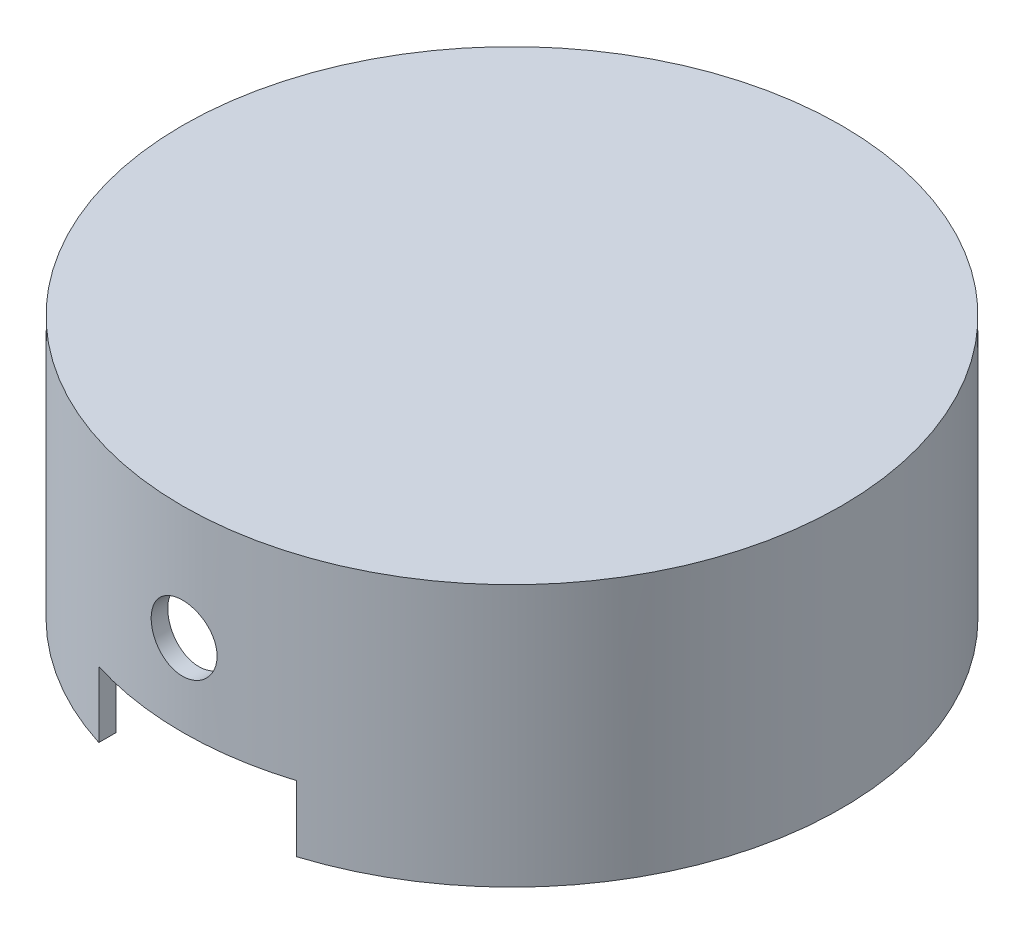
ISO-10303-21;
HEADER;
FILE_DESCRIPTION(('STEP AP214'),'2;1');
FILE_NAME('part.step','',(''),(''),'','','');
FILE_SCHEMA(('AUTOMOTIVE_DESIGN { 1 0 10303 214 1 1 1 1 }'));
ENDSEC;
DATA;
#1=APPLICATION_CONTEXT('core data for automotive mechanical design processes');
#2=APPLICATION_PROTOCOL_DEFINITION('international standard','automotive_design',2000,#1);
#3=PRODUCT_CONTEXT('',#1,'mechanical');
#4=PRODUCT('Part','Part','',(#3));
#5=PRODUCT_RELATED_PRODUCT_CATEGORY('part','',(#4));
#6=PRODUCT_DEFINITION_FORMATION('','',#4);
#7=PRODUCT_DEFINITION_CONTEXT('part definition',#1,'design');
#8=PRODUCT_DEFINITION('design','',#6,#7);
#9=PRODUCT_DEFINITION_SHAPE('','',#8);
#10=(LENGTH_UNIT() NAMED_UNIT(*) SI_UNIT(.MILLI.,.METRE.));
#11=(NAMED_UNIT(*) PLANE_ANGLE_UNIT() SI_UNIT($,.RADIAN.));
#12=(NAMED_UNIT(*) SI_UNIT($,.STERADIAN.) SOLID_ANGLE_UNIT());
#13=UNCERTAINTY_MEASURE_WITH_UNIT(LENGTH_MEASURE(1.E-05),#10,'distance_accuracy_value','');
#14=(GEOMETRIC_REPRESENTATION_CONTEXT(3) GLOBAL_UNCERTAINTY_ASSIGNED_CONTEXT((#13)) GLOBAL_UNIT_ASSIGNED_CONTEXT((#10,
#11,#12)) REPRESENTATION_CONTEXT('',''));
#15=CARTESIAN_POINT('',(0.,0.,0.));
#16=DIRECTION('',(0.,0.,1.));
#17=DIRECTION('',(1.,0.,0.));
#18=AXIS2_PLACEMENT_3D('',#15,#16,#17);
#19=CARTESIAN_POINT('',(0.,-50.4824999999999,0.));
#20=DIRECTION('',(0.,1.,0.));
#21=DIRECTION('',(0.,0.,1.));
#22=AXIS2_PLACEMENT_3D('',#19,#20,#21);
#23=PLANE('',#22);
#24=CARTESIAN_POINT('',(0.,-50.4824999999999,0.));
#25=DIRECTION('',(0.,1.,0.));
#26=DIRECTION('',(0.,0.,1.));
#27=AXIS2_PLACEMENT_3D('',#24,#25,#26);
#28=CIRCLE('',#27,63.5);
#29=CARTESIAN_POINT('',(19.05,-50.4824999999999,60.575139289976));
#30=VERTEX_POINT('',#29);
#31=CARTESIAN_POINT('',(19.05,-50.4824999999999,-60.5751392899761));
#32=VERTEX_POINT('',#31);
#33=EDGE_CURVE('E152',#30,#32,#28,.T.);
#34=ORIENTED_EDGE('',*,*,#33,.F.);
#35=DIRECTION('',(0.,0.,1.));
#36=VECTOR('',#35,1.);
#37=CARTESIAN_POINT('',(19.05,-50.4824999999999,-63.5));
#38=LINE('',#37,#36);
#39=CARTESIAN_POINT('',(19.05,-50.4824999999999,57.2381264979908));
#40=VERTEX_POINT('',#39);
#41=EDGE_CURVE('E194',#40,#30,#38,.T.);
#42=ORIENTED_EDGE('',*,*,#41,.F.);
#43=CARTESIAN_POINT('',(0.,-50.4824999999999,0.));
#44=DIRECTION('',(0.,1.,0.));
#45=DIRECTION('',(0.,0.,1.));
#46=AXIS2_PLACEMENT_3D('',#43,#44,#45);
#47=CIRCLE('',#46,60.325);
#48=CARTESIAN_POINT('',(19.05,-50.4824999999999,-57.2381264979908));
#49=VERTEX_POINT('',#48);
#50=EDGE_CURVE('E146',#40,#49,#47,.T.);
#51=ORIENTED_EDGE('',*,*,#50,.T.);
#52=EDGE_CURVE('E133',#32,#49,#38,.T.);
#53=ORIENTED_EDGE('',*,*,#52,.F.);
#54=EDGE_LOOP('',(#34,#42,#51,#53));
#55=FACE_BOUND('',#54,.T.);
#56=ADVANCED_FACE('F35',(#55),#23,.F.);
#57=CARTESIAN_POINT('',(0.,-50.4824999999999,0.));
#58=DIRECTION('',(0.,1.,0.));
#59=DIRECTION('',(0.,0.,1.));
#60=AXIS2_PLACEMENT_3D('',#57,#58,#59);
#61=CYLINDRICAL_SURFACE('',#60,63.5);
#62=CARTESIAN_POINT('',(6.35,-22.06625,-63.1817022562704));
#63=CARTESIAN_POINT('',(6.3500017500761,-22.2441750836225,-63.1817017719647));
#64=CARTESIAN_POINT('',(6.34251906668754,-22.4220734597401,-63.1824553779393));
#65=CARTESIAN_POINT('',(6.31264389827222,-22.7766583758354,-63.185447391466));
#66=CARTESIAN_POINT('',(6.2902478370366,-22.9533446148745,-63.1876861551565));
#67=CARTESIAN_POINT('',(6.23068068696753,-23.3043257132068,-63.1935875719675));
#68=CARTESIAN_POINT('',(6.19349781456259,-23.4786185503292,-63.1972513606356));
#69=CARTESIAN_POINT('',(6.10461324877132,-23.8234972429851,-63.2058991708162));
#70=CARTESIAN_POINT('',(6.05290624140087,-23.9940817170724,-63.2108836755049));
#71=CARTESIAN_POINT('',(5.93541227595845,-24.3301028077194,-63.2220242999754));
#72=CARTESIAN_POINT('',(5.86963914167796,-24.495544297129,-63.2281792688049));
#73=CARTESIAN_POINT('',(5.7244295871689,-24.8203494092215,-63.2414912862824));
#74=CARTESIAN_POINT('',(5.64498813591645,-24.9797107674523,-63.2486487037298));
#75=CARTESIAN_POINT('',(5.47307546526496,-25.2910839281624,-63.2637564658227));
#76=CARTESIAN_POINT('',(5.38061172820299,-25.4430998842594,-63.2717063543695));
#77=CARTESIAN_POINT('',(5.18323831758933,-25.7388733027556,-63.288180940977));
#78=CARTESIAN_POINT('',(5.07832404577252,-25.8826276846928,-63.2967058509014));
#79=CARTESIAN_POINT('',(4.85649733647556,-26.1612138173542,-63.314112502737));
#80=CARTESIAN_POINT('',(4.73955137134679,-26.2960188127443,-63.3229951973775));
#81=CARTESIAN_POINT('',(4.49469000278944,-26.5553564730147,-63.3408464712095));
#82=CARTESIAN_POINT('',(4.36677056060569,-26.6798853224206,-63.3498150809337));
#83=CARTESIAN_POINT('',(4.10094045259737,-26.9177015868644,-63.3675786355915));
#84=CARTESIAN_POINT('',(3.96303302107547,-27.0309926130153,-63.3763736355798));
#85=CARTESIAN_POINT('',(3.67810498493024,-27.2456194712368,-63.3935479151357));
#86=CARTESIAN_POINT('',(3.53108103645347,-27.3469508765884,-63.4019270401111));
#87=CARTESIAN_POINT('',(3.22873480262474,-27.5370555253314,-63.4180433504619));
#88=CARTESIAN_POINT('',(3.07339857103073,-27.6258066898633,-63.425779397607));
#89=CARTESIAN_POINT('',(2.75570516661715,-27.7899352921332,-63.4403766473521));
#90=CARTESIAN_POINT('',(2.59334541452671,-27.8653077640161,-63.4472375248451));
#91=CARTESIAN_POINT('',(2.2628583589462,-28.0020669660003,-63.4598831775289));
#92=CARTESIAN_POINT('',(2.09473332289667,-28.0634591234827,-63.4656683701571));
#93=CARTESIAN_POINT('',(1.75385494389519,-28.1718656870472,-63.4760047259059));
#94=CARTESIAN_POINT('',(1.58109992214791,-28.2188747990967,-63.4805554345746));
#95=CARTESIAN_POINT('',(1.0590306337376,-28.3374295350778,-63.4921149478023));
#96=CARTESIAN_POINT('',(0.704424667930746,-28.3871161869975,-63.4970898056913));
#97=CARTESIAN_POINT('',(-0.00793262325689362,-28.4262709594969,-63.5010003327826));
#98=CARTESIAN_POINT('',(-0.365683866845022,-28.4157406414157,-63.4999361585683));
#99=CARTESIAN_POINT('',(-1.07306478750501,-28.335000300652,-63.4919139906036));
#100=CARTESIAN_POINT('',(-1.42271891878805,-28.2650036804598,-63.484977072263));
#101=CARTESIAN_POINT('',(-2.10527764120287,-28.0676291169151,-63.466010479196));
#102=CARTESIAN_POINT('',(-2.43818201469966,-27.9402504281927,-63.4539807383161));
#103=CARTESIAN_POINT('',(-3.07848096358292,-27.6314991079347,-63.4261454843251));
#104=CARTESIAN_POINT('',(-3.38582969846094,-27.4500320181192,-63.4103333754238));
#105=CARTESIAN_POINT('',(-3.96578808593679,-27.0383221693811,-63.3767074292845));
#106=CARTESIAN_POINT('',(-4.23839671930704,-26.8080779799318,-63.3588935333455));
#107=CARTESIAN_POINT('',(-4.7423880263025,-26.3041496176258,-63.3231711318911));
#108=CARTESIAN_POINT('',(-4.97358506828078,-26.0302797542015,-63.3052625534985));
#109=CARTESIAN_POINT('',(-5.3867528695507,-25.447517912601,-63.2714469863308));
#110=CARTESIAN_POINT('',(-5.56872355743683,-25.1386258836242,-63.2555400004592));
#111=CARTESIAN_POINT('',(-5.8782723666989,-24.4944453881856,-63.2275271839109));
#112=CARTESIAN_POINT('',(-6.00583901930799,-24.1591513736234,-63.215422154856));
#113=CARTESIAN_POINT('',(-6.20281167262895,-23.471755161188,-63.1964002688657));
#114=CARTESIAN_POINT('',(-6.27221944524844,-23.1196534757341,-63.1894832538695));
#115=CARTESIAN_POINT('',(-6.35066532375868,-22.4102664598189,-63.1816478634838));
#116=CARTESIAN_POINT('',(-6.35996313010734,-22.053010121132,-63.1807036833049));
#117=CARTESIAN_POINT('',(-6.31860716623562,-21.342024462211,-63.1848527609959));
#118=CARTESIAN_POINT('',(-6.26795420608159,-20.9882950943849,-63.1899459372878));
#119=CARTESIAN_POINT('',(-6.10835186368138,-20.2951614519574,-63.2055723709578));
#120=CARTESIAN_POINT('',(-5.99952527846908,-19.9557286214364,-63.2160941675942));
#121=CARTESIAN_POINT('',(-5.72679014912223,-19.2999356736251,-63.2413829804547));
#122=CARTESIAN_POINT('',(-5.56288034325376,-18.9835760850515,-63.2561500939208));
#123=CARTESIAN_POINT('',(-5.1839813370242,-18.3817261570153,-63.2883281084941));
#124=CARTESIAN_POINT('',(-4.9688200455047,-18.0963446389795,-63.3057478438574));
#125=CARTESIAN_POINT('',(-4.49377109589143,-17.5656554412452,-63.3412393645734));
#126=CARTESIAN_POINT('',(-4.23388233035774,-17.3203487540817,-63.3593111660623));
#127=CARTESIAN_POINT('',(-3.67563384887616,-16.8758765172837,-63.3941485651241));
#128=CARTESIAN_POINT('',(-3.3771389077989,-16.6768803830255,-63.4109092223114));
#129=CARTESIAN_POINT('',(-2.75080142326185,-16.3318456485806,-63.4411634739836));
#130=CARTESIAN_POINT('',(-2.42295928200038,-16.1858063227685,-63.4546571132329));
#131=CARTESIAN_POINT('',(-1.74789161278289,-15.9511110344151,-63.4768362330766));
#132=CARTESIAN_POINT('',(-1.40070185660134,-15.8623527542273,-63.4855302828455));
#133=CARTESIAN_POINT('',(-0.696060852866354,-15.744430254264,-63.4971598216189));
#134=CARTESIAN_POINT('',(-0.338609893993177,-15.7152643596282,-63.5000954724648));
#135=CARTESIAN_POINT('',(0.196292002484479,-15.7167810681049,-63.4999484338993));
#136=CARTESIAN_POINT('',(0.374087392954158,-15.7247805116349,-63.4991460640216));
#137=CARTESIAN_POINT('',(0.728350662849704,-15.7556591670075,-63.496068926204));
#138=CARTESIAN_POINT('',(0.904819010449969,-15.7785328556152,-63.4937947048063));
#139=CARTESIAN_POINT('',(1.25524246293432,-15.8390107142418,-63.4878344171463));
#140=CARTESIAN_POINT('',(1.42919662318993,-15.8766202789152,-63.4841478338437));
#141=CARTESIAN_POINT('',(1.77324566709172,-15.9662758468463,-63.4754692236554));
#142=CARTESIAN_POINT('',(1.94334193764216,-16.0183165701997,-63.4704776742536));
#143=CARTESIAN_POINT('',(2.27857375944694,-16.1364779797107,-63.4593274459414));
#144=CARTESIAN_POINT('',(2.44370818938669,-16.2026018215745,-63.4531685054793));
#145=CARTESIAN_POINT('',(2.76775783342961,-16.3484206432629,-63.4398597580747));
#146=CARTESIAN_POINT('',(2.92667529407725,-16.4281106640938,-63.4327103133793));
#147=CARTESIAN_POINT('',(3.23729834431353,-16.6005418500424,-63.4176165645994));
#148=CARTESIAN_POINT('',(3.38900136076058,-16.6932876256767,-63.4096719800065));
#149=CARTESIAN_POINT('',(3.6840239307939,-16.8911171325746,-63.3932156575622));
#150=CARTESIAN_POINT('',(3.82734650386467,-16.9961963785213,-63.3847041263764));
#151=CARTESIAN_POINT('',(4.10530492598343,-17.2184892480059,-63.3673098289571));
#152=CARTESIAN_POINT('',(4.23989814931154,-17.3357560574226,-63.3584255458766));
#153=CARTESIAN_POINT('',(4.49868758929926,-17.5811528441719,-63.3405764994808));
#154=CARTESIAN_POINT('',(4.62288758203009,-17.7092788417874,-63.3316117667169));
#155=CARTESIAN_POINT('',(4.86014582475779,-17.9756133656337,-63.31384641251));
#156=CARTESIAN_POINT('',(4.97319724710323,-18.1138279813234,-63.3050458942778));
#157=CARTESIAN_POINT('',(5.18723467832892,-18.3992479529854,-63.2878671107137));
#158=CARTESIAN_POINT('',(5.28822512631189,-18.5464499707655,-63.279488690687));
#159=CARTESIAN_POINT('',(5.47774928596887,-18.8493004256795,-63.2633649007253));
#160=CARTESIAN_POINT('',(5.56624575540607,-19.0049722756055,-63.2556214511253));
#161=CARTESIAN_POINT('',(5.72976430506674,-19.323205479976,-63.2410194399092));
#162=CARTESIAN_POINT('',(5.80479131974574,-19.4857642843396,-63.2341605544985));
#163=CARTESIAN_POINT('',(5.94081215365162,-19.8165391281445,-63.2215265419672));
#164=CARTESIAN_POINT('',(6.00181747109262,-19.9847504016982,-63.2157505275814));
#165=CARTESIAN_POINT('',(6.10941404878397,-20.3256989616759,-63.2054425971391));
#166=CARTESIAN_POINT('',(6.15600885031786,-20.4984351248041,-63.20091037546));
#167=CARTESIAN_POINT('',(6.24659918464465,-20.901235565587,-63.1920304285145));
#168=CARTESIAN_POINT('',(6.28533720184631,-21.1325126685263,-63.1881729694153));
#169=CARTESIAN_POINT('',(6.33703640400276,-21.5979586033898,-63.1830092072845));
#170=CARTESIAN_POINT('',(6.34999769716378,-21.832127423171,-63.1817028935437));
#171=CARTESIAN_POINT('',(6.35,-22.06625,-63.1817022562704));
#172=B_SPLINE_CURVE_WITH_KNOTS('',3,(#62,#63,#64,#65,#66,#67,#68,#69,#70,#71,#72,#73,#74,#75,
#76,#77,#78,#79,#80,#81,#82,#83,#84,#85,#86,#87,#88,#89,#90,#91,#92,#93,#94,#95,#96,#97,#98,#99,
#100,#101,#102,#103,#104,#105,#106,#107,#108,#109,#110,#111,#112,#113,#114,#115,#116,#117,#118,
#119,#120,#121,#122,#123,#124,#125,#126,#127,#128,#129,#130,#131,#132,#133,#134,#135,#136,#137,
#138,#139,#140,#141,#142,#143,#144,#145,#146,#147,#148,#149,#150,#151,#152,#153,#154,#155,#156,
#157,#158,#159,#160,#161,#162,#163,#164,#165,#166,#167,#168,#169,#170,#171),.UNSPECIFIED.,.T.,
.F.,(4,2,2,2,2,2,2,2,2,2,2,2,2,2,2,2,2,2,2,2,2,2,2,2,2,2,2,2,2,2,2,2,2,2,2,2,2,2,2,2,2,2,2,2,2,
2,2,2,2,2,2,2,2,2,4),(0.,0.533570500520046,1.06726899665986,1.60139365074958,2.13571398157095,
2.6695115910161,3.20350610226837,3.73719503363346,4.27108168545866,4.80649858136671,
5.34211338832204,5.87755552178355,6.41319522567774,6.94976365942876,7.48653084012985,
8.0230892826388,8.55984498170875,9.62858735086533,10.6973020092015,11.7621975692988,
12.8271069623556,13.893887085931,14.9606985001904,16.0321784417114,17.103659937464,
18.1753671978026,19.2470418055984,20.3140832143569,21.38111020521,22.4458936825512,
23.5107015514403,24.5791365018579,25.6475979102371,26.7199086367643,27.7922046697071,
28.8625799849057,29.9329252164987,30.4663374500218,30.9995517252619,31.5329613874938,
32.066176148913,32.59951051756,33.1326503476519,33.6659789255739,34.1991141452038,
34.7346822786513,35.2700549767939,35.8057535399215,36.34125432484,36.8783190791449,
37.4151866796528,37.9516124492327,38.4879062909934,39.1900075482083,39.8921058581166),.UNSPECIFIED.);
#173=CARTESIAN_POINT('',(6.35,-22.06625,-63.1817022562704));
#174=VERTEX_POINT('',#173);
#175=EDGE_CURVE('E185',#174,#174,#172,.T.);
#176=ORIENTED_EDGE('',*,*,#175,.F.);
#177=EDGE_LOOP('',(#176));
#178=FACE_BOUND('',#177,.T.);
#179=CARTESIAN_POINT('',(0.,-28.41625,63.5));
#180=CARTESIAN_POINT('',(0.177927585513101,-28.4162517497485,63.5000004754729));
#181=CARTESIAN_POINT('',(0.355828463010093,-28.4087688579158,63.4992506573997));
#182=CARTESIAN_POINT('',(0.710418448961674,-28.3788928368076,63.4962733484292));
#183=CARTESIAN_POINT('',(0.887107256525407,-28.356496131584,63.4940455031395));
#184=CARTESIAN_POINT('',(1.23809354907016,-28.2969272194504,63.4881718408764));
#185=CARTESIAN_POINT('',(1.41238901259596,-28.259743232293,63.4845248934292));
#186=CARTESIAN_POINT('',(1.75727301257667,-28.1708559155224,63.4759147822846));
#187=CARTESIAN_POINT('',(1.92786016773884,-28.1191472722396,63.4709511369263));
#188=CARTESIAN_POINT('',(2.26388696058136,-28.0016493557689,63.4598538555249));
#189=CARTESIAN_POINT('',(2.42933145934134,-27.9358738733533,63.453721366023));
#190=CARTESIAN_POINT('',(2.7541423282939,-27.7906590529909,63.4404534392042));
#191=CARTESIAN_POINT('',(2.9135064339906,-27.7112146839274,63.4333176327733));
#192=CARTESIAN_POINT('',(3.2248845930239,-27.5392957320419,63.4182497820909));
#193=CARTESIAN_POINT('',(3.37690280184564,-27.4468286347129,63.4103181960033));
#194=CARTESIAN_POINT('',(3.67268009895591,-27.2494481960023,63.3938748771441));
#195=CARTESIAN_POINT('',(3.81643610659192,-27.1445302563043,63.3853629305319));
#196=CARTESIAN_POINT('',(4.09501996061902,-26.9226998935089,63.3679757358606));
#197=CARTESIAN_POINT('',(4.22982137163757,-26.8057543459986,63.3590995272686));
#198=CARTESIAN_POINT('',(4.4891518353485,-26.5608945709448,63.341253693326));
#199=CARTESIAN_POINT('',(4.61367707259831,-26.4329763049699,63.332284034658));
#200=CARTESIAN_POINT('',(4.85148627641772,-26.1671492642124,63.3145109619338));
#201=CARTESIAN_POINT('',(4.96477384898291,-26.0292437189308,63.3057074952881));
#202=CARTESIAN_POINT('',(5.17939407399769,-25.7443201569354,63.2885098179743));
#203=CARTESIAN_POINT('',(5.28072229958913,-25.5972987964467,63.2801157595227));
#204=CARTESIAN_POINT('',(5.47082337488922,-25.2949545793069,63.263964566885));
#205=CARTESIAN_POINT('',(5.55957383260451,-25.1396175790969,63.2562085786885));
#206=CARTESIAN_POINT('',(5.72370093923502,-24.8219226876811,63.2415689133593));
#207=CARTESIAN_POINT('',(5.79907262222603,-24.659562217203,63.2346855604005));
#208=CARTESIAN_POINT('',(5.93583019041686,-24.3290736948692,63.2219949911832));
#209=CARTESIAN_POINT('',(5.9972215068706,-24.1609479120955,63.2161873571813));
#210=CARTESIAN_POINT('',(6.10562634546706,-23.8200678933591,63.2058086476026));
#211=CARTESIAN_POINT('',(6.15263457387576,-23.6473119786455,63.2012380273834));
#212=CARTESIAN_POINT('',(6.27118672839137,-23.1252388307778,63.1896263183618));
#213=CARTESIAN_POINT('',(6.32087139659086,-22.7706295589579,63.1846265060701));
#214=CARTESIAN_POINT('',(6.36002106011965,-22.0582657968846,63.1806969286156));
#215=CARTESIAN_POINT('',(6.34948763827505,-21.7005113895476,63.1817670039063));
#216=CARTESIAN_POINT('',(6.26874238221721,-20.9931441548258,63.189828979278));
#217=CARTESIAN_POINT('',(6.19874707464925,-20.6435065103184,63.1967993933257));
#218=CARTESIAN_POINT('',(6.00138085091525,-19.9609800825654,63.2158458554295));
#219=CARTESIAN_POINT('',(5.8740091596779,-19.628091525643,63.2279219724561));
#220=CARTESIAN_POINT('',(5.56527233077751,-18.9878117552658,63.2558431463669));
#221=CARTESIAN_POINT('',(5.38381110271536,-18.6804671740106,63.2716949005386));
#222=CARTESIAN_POINT('',(4.97211376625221,-18.1005146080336,63.3053757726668));
#223=CARTESIAN_POINT('',(4.7418762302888,-17.8279076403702,63.3232049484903));
#224=CARTESIAN_POINT('',(4.2379525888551,-17.3239088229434,63.358927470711));
#225=CARTESIAN_POINT('',(3.96407943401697,-17.0927039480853,63.3768207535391));
#226=CARTESIAN_POINT('',(3.38130821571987,-16.6795219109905,63.4105811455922));
#227=CARTESIAN_POINT('',(3.07241011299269,-16.4975448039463,63.4264482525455));
#228=CARTESIAN_POINT('',(2.42822796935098,-16.1879913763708,63.4543737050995));
#229=CARTESIAN_POINT('',(2.09293933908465,-16.0604245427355,63.4664313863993));
#230=CARTESIAN_POINT('',(1.40555483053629,-15.8634498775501,63.4853726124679));
#231=CARTESIAN_POINT('',(1.05345945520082,-15.7940403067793,63.4922563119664));
#232=CARTESIAN_POINT('',(0.344075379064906,-15.7155876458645,63.5000540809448));
#233=CARTESIAN_POINT('',(-0.0131845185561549,-15.706286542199,63.5009936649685));
#234=CARTESIAN_POINT('',(-0.72417808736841,-15.7476371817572,63.4968657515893));
#235=CARTESIAN_POINT('',(-1.07791180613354,-15.7982881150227,63.4917983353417));
#236=CARTESIAN_POINT('',(-1.77106711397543,-15.9578909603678,63.4762422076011));
#237=CARTESIAN_POINT('',(-2.11051679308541,-16.0667220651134,63.465764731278));
#238=CARTESIAN_POINT('',(-2.76634143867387,-16.339471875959,63.4405639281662));
#239=CARTESIAN_POINT('',(-3.08271588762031,-16.5033918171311,63.4258405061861));
#240=CARTESIAN_POINT('',(-3.68457595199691,-16.882305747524,63.3937311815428));
#241=CARTESIAN_POINT('',(-3.96995436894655,-17.0974692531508,63.3763365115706));
#242=CARTESIAN_POINT('',(-4.50063627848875,-17.5725208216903,63.3408647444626));
#243=CARTESIAN_POINT('',(-4.7459387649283,-17.8324100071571,63.3227876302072));
#244=CARTESIAN_POINT('',(-5.19040190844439,-18.3906566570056,63.2879115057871));
#245=CARTESIAN_POINT('',(-5.38939323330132,-18.6891492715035,63.2711173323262));
#246=CARTESIAN_POINT('',(-5.73441952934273,-19.3154808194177,63.2407824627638));
#247=CARTESIAN_POINT('',(-5.88045522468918,-19.6433193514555,63.2272417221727));
#248=CARTESIAN_POINT('',(-6.11514811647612,-20.3183892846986,63.204975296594));
#249=CARTESIAN_POINT('',(-6.20390605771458,-20.6655854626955,63.1962411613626));
#250=CARTESIAN_POINT('',(-6.32182569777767,-21.3702400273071,63.1845566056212));
#251=CARTESIAN_POINT('',(-6.35098910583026,-21.7276981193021,63.1816060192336));
#252=CARTESIAN_POINT('',(-6.34946694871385,-22.2626012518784,63.1817542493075));
#253=CARTESIAN_POINT('',(-6.34146616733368,-22.440391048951,63.1825608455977));
#254=CARTESIAN_POINT('',(-6.3105857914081,-22.794642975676,63.1856534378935));
#255=CARTESIAN_POINT('',(-6.28771171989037,-22.9711055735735,63.1879388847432));
#256=CARTESIAN_POINT('',(-6.22723408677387,-23.3215174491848,63.1939274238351));
#257=CARTESIAN_POINT('',(-6.18962512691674,-23.4954657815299,63.1976310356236));
#258=CARTESIAN_POINT('',(-6.09997180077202,-23.8395031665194,63.2063475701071));
#259=CARTESIAN_POINT('',(-6.04793271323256,-24.0095936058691,63.2113600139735));
#260=CARTESIAN_POINT('',(-5.92977573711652,-24.344813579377,63.2225535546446));
#261=CARTESIAN_POINT('',(-5.86365472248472,-24.5099420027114,63.2287349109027));
#262=CARTESIAN_POINT('',(-5.71784258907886,-24.8339800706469,63.2420874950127));
#263=CARTESIAN_POINT('',(-5.6381564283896,-24.9928919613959,63.2492583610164));
#264=CARTESIAN_POINT('',(-5.46573385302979,-25.3035045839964,63.2643915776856));
#265=CARTESIAN_POINT('',(-5.37299282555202,-25.4552027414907,63.2723542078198));
#266=CARTESIAN_POINT('',(-5.1751735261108,-25.7502165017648,63.2888412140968));
#267=CARTESIAN_POINT('',(-5.0700997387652,-25.8935351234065,63.2973653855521));
#268=CARTESIAN_POINT('',(-4.84781261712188,-26.1714938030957,63.3147786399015));
#269=CARTESIAN_POINT('',(-4.73054550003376,-26.3060907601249,63.3236692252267));
#270=CARTESIAN_POINT('',(-4.4851473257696,-26.5648876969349,63.341523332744));
#271=CARTESIAN_POINT('',(-4.35702024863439,-26.6890914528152,63.3504868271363));
#272=CARTESIAN_POINT('',(-4.09068282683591,-26.9263570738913,63.3682423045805));
#273=CARTESIAN_POINT('',(-3.95246639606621,-27.0394121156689,63.3770341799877));
#274=CARTESIAN_POINT('',(-3.66704208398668,-27.2534565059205,63.3941892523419));
#275=CARTESIAN_POINT('',(-3.51983754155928,-27.3544502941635,63.402552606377));
#276=CARTESIAN_POINT('',(-3.21698526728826,-27.5439783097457,63.418641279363));
#277=CARTESIAN_POINT('',(-3.06131432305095,-27.6324756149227,63.4263646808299));
#278=CARTESIAN_POINT('',(-2.74308287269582,-27.795995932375,63.4409241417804));
#279=CARTESIAN_POINT('',(-2.58052491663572,-27.8710238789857,63.4477605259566));
#280=CARTESIAN_POINT('',(-2.24975177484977,-28.007046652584,63.4603496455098));
#281=CARTESIAN_POINT('',(-2.08154135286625,-28.0680529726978,63.4661032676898));
#282=CARTESIAN_POINT('',(-1.74059463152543,-28.1756516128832,63.4763690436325));
#283=CARTESIAN_POINT('',(-1.56785945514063,-28.2222474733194,63.4808815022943));
#284=CARTESIAN_POINT('',(-1.16505255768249,-28.3128423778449,63.4897216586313));
#285=CARTESIAN_POINT('',(-0.93376784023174,-28.351582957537,63.4935607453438));
#286=CARTESIAN_POINT('',(-0.468306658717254,-28.4032855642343,63.4986995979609));
#287=CARTESIAN_POINT('',(-0.234130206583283,-28.4162476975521,63.4999993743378));
#288=CARTESIAN_POINT('',(0.,-28.41625,63.5));
#289=B_SPLINE_CURVE_WITH_KNOTS('',3,(#179,#180,#181,#182,#183,#184,#185,#186,#187,#188,#189,
#190,#191,#192,#193,#194,#195,#196,#197,#198,#199,#200,#201,#202,#203,#204,#205,#206,#207,#208,
#209,#210,#211,#212,#213,#214,#215,#216,#217,#218,#219,#220,#221,#222,#223,#224,#225,#226,#227,
#228,#229,#230,#231,#232,#233,#234,#235,#236,#237,#238,#239,#240,#241,#242,#243,#244,#245,#246,
#247,#248,#249,#250,#251,#252,#253,#254,#255,#256,#257,#258,#259,#260,#261,#262,#263,#264,#265,
#266,#267,#268,#269,#270,#271,#272,#273,#274,#275,#276,#277,#278,#279,#280,#281,#282,#283,#284,
#285,#286,#287,#288),.UNSPECIFIED.,.T.,.F.,(4,2,2,2,2,2,2,2,2,2,2,2,2,2,2,2,2,2,2,2,2,2,2,2,2,2,
2,2,2,2,2,2,2,2,2,2,2,2,2,2,2,2,2,2,2,2,2,2,2,2,2,2,2,2,4),(0.,0.533578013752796,
1.0672840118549,1.60141603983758,2.13574372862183,2.66954995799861,3.20355308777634,
3.73725051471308,4.27114566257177,4.80655268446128,5.34215761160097,5.87759011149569,
6.41322018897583,6.94979217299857,7.48656290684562,8.02312475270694,8.55988384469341,
9.62863568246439,10.6973594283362,11.7622080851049,12.8270711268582,13.8938372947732,
14.9606346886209,16.0321345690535,17.1036356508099,18.1753234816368,19.2469792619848,
20.314031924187,21.38107017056,22.4459013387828,23.5107563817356,24.5791841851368,
25.647638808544,26.7199408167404,27.7922281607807,28.8626243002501,29.9329897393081,
30.466385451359,30.9995832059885,31.5329764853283,32.0661748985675,32.599491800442,
33.1326141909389,33.6659254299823,34.1990433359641,34.7346214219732,35.2700040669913,
35.8057123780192,36.3412228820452,36.8782839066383,37.41514778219,37.951570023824,
38.4878603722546,39.1899844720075,39.8921056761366),.UNSPECIFIED.);
#290=CARTESIAN_POINT('',(0.,-28.41625,63.5));
#291=VERTEX_POINT('',#290);
#292=EDGE_CURVE('E189',#291,#291,#289,.T.);
#293=ORIENTED_EDGE('',*,*,#292,.F.);
#294=EDGE_LOOP('',(#293));
#295=FACE_BOUND('',#294,.T.);
#296=DIRECTION('',(0.,1.,0.));
#297=VECTOR('',#296,1.);
#298=CARTESIAN_POINT('',(-19.05,-50.4824999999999,60.5751392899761));
#299=LINE('',#298,#297);
#300=CARTESIAN_POINT('',(-19.05,-37.7824999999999,60.5751392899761));
#301=VERTEX_POINT('',#300);
#302=CARTESIAN_POINT('',(-19.05,-50.4824999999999,60.575139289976));
#303=VERTEX_POINT('',#302);
#304=EDGE_CURVE('E118',#301,#303,#299,.F.);
#305=ORIENTED_EDGE('',*,*,#304,.F.);
#306=CARTESIAN_POINT('',(0.,-37.7824999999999,0.));
#307=DIRECTION('',(0.,1.,0.));
#308=DIRECTION('',(0.,0.,1.));
#309=AXIS2_PLACEMENT_3D('',#306,#307,#308);
#310=CIRCLE('',#309,63.5);
#311=CARTESIAN_POINT('',(19.05,-37.7824999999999,60.5751392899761));
#312=VERTEX_POINT('',#311);
#313=EDGE_CURVE('E131',#312,#301,#310,.F.);
#314=ORIENTED_EDGE('',*,*,#313,.F.);
#315=DIRECTION('',(0.,1.,0.));
#316=VECTOR('',#315,1.);
#317=CARTESIAN_POINT('',(19.05,-50.4824999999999,60.5751392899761));
#318=LINE('',#317,#316);
#319=EDGE_CURVE('E138',#30,#312,#318,.T.);
#320=ORIENTED_EDGE('',*,*,#319,.F.);
#321=ORIENTED_EDGE('',*,*,#33,.T.);
#322=DIRECTION('',(0.,1.,0.));
#323=VECTOR('',#322,1.);
#324=CARTESIAN_POINT('',(19.05,-50.4824999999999,-60.5751392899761));
#325=LINE('',#324,#323);
#326=CARTESIAN_POINT('',(19.05,-37.7824999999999,-60.5751392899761));
#327=VERTEX_POINT('',#326);
#328=EDGE_CURVE('E130',#327,#32,#325,.F.);
#329=ORIENTED_EDGE('',*,*,#328,.F.);
#330=CARTESIAN_POINT('',(-19.05,-37.7824999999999,-60.5751392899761));
#331=VERTEX_POINT('',#330);
#332=EDGE_CURVE('E119',#331,#327,#310,.F.);
#333=ORIENTED_EDGE('',*,*,#332,.F.);
#334=DIRECTION('',(0.,1.,0.));
#335=VECTOR('',#334,1.);
#336=CARTESIAN_POINT('',(-19.05,-50.4824999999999,-60.5751392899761));
#337=LINE('',#336,#335);
#338=CARTESIAN_POINT('',(-19.05,-50.4824999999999,-60.5751392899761));
#339=VERTEX_POINT('',#338);
#340=EDGE_CURVE('E107',#339,#331,#337,.T.);
#341=ORIENTED_EDGE('',*,*,#340,.F.);
#342=EDGE_CURVE('E150',#339,#303,#28,.T.);
#343=ORIENTED_EDGE('',*,*,#342,.T.);
#344=EDGE_LOOP('',(#305,#314,#320,#321,#329,#333,#341,#343));
#345=FACE_BOUND('',#344,.T.);
#346=CARTESIAN_POINT('',(0.,0.,0.));
#347=DIRECTION('',(0.,1.,0.));
#348=DIRECTION('',(0.,0.,1.));
#349=AXIS2_PLACEMENT_3D('',#346,#347,#348);
#350=CIRCLE('',#349,63.5);
#351=CARTESIAN_POINT('',(0.,0.,63.5));
#352=VERTEX_POINT('',#351);
#353=EDGE_CURVE('E149',#352,#352,#350,.T.);
#354=ORIENTED_EDGE('',*,*,#353,.F.);
#355=EDGE_LOOP('',(#354));
#356=FACE_BOUND('',#355,.T.);
#357=ADVANCED_FACE('F37',(#178,#295,#345,#356),#61,.T.);
#358=ORIENTED_EDGE('',*,*,#342,.F.);
#359=DIRECTION('',(0.,0.,1.));
#360=VECTOR('',#359,1.);
#361=CARTESIAN_POINT('',(-19.05,-50.4824999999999,-63.5));
#362=LINE('',#361,#360);
#363=CARTESIAN_POINT('',(-19.05,-50.4824999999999,-57.2381264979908));
#364=VERTEX_POINT('',#363);
#365=EDGE_CURVE('E113',#339,#364,#362,.T.);
#366=ORIENTED_EDGE('',*,*,#365,.T.);
#367=CARTESIAN_POINT('',(-19.05,-50.4824999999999,57.2381264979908));
#368=VERTEX_POINT('',#367);
#369=EDGE_CURVE('E145',#364,#368,#47,.T.);
#370=ORIENTED_EDGE('',*,*,#369,.T.);
#371=EDGE_CURVE('E124',#368,#303,#362,.T.);
#372=ORIENTED_EDGE('',*,*,#371,.T.);
#373=EDGE_LOOP('',(#358,#366,#370,#372));
#374=FACE_BOUND('',#373,.T.);
#375=ADVANCED_FACE('F213',(#374),#23,.F.);
#376=CARTESIAN_POINT('',(0.,0.,0.));
#377=DIRECTION('',(0.,1.,0.));
#378=DIRECTION('',(0.,0.,1.));
#379=AXIS2_PLACEMENT_3D('',#376,#377,#378);
#380=PLANE('',#379);
#381=ORIENTED_EDGE('',*,*,#353,.T.);
#382=EDGE_LOOP('',(#381));
#383=FACE_BOUND('',#382,.T.);
#384=ADVANCED_FACE('F216',(#383),#380,.T.);
#385=CARTESIAN_POINT('',(0.,-50.4824999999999,0.));
#386=DIRECTION('',(0.,1.,0.));
#387=DIRECTION('',(0.,0.,1.));
#388=AXIS2_PLACEMENT_3D('',#385,#386,#387);
#389=CYLINDRICAL_SURFACE('',#388,60.325);
#390=CARTESIAN_POINT('',(0.,-28.41625,60.325));
#391=CARTESIAN_POINT('',(0.177876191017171,-28.4162518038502,60.3250005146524));
#392=CARTESIAN_POINT('',(0.355725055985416,-28.4087732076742,60.3242116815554));
#393=CARTESIAN_POINT('',(0.710210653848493,-28.3789147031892,60.3210794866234));
#394=CARTESIAN_POINT('',(0.886847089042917,-28.3565312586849,60.3187357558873));
#395=CARTESIAN_POINT('',(1.23772650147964,-28.2969985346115,60.3125565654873));
#396=CARTESIAN_POINT('',(1.4119674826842,-28.2598376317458,60.3087199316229));
#397=CARTESIAN_POINT('',(1.75674281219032,-28.1710067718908,60.2996619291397));
#398=CARTESIAN_POINT('',(1.9272757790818,-28.1193315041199,60.2944400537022));
#399=CARTESIAN_POINT('',(2.26319316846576,-28.0019119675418,60.2827653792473));
#400=CARTESIAN_POINT('',(2.42858251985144,-27.936181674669,60.2763138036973));
#401=CARTESIAN_POINT('',(2.75328604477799,-27.7910687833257,60.2623552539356));
#402=CARTESIAN_POINT('',(2.91259795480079,-27.7116811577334,60.2548478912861));
#403=CARTESIAN_POINT('',(3.22387750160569,-27.539886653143,60.2389949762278));
#404=CARTESIAN_POINT('',(3.37584925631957,-27.4474871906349,60.2306499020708));
#405=CARTESIAN_POINT('',(3.67154088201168,-27.2502526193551,60.2133486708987));
#406=CARTESIAN_POINT('',(3.81525767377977,-27.1454129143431,60.2043922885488));
#407=CARTESIAN_POINT('',(4.09381870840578,-26.9237118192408,60.1860932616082));
#408=CARTESIAN_POINT('',(4.22863345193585,-26.8068134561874,60.1767494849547));
#409=CARTESIAN_POINT('',(4.48799541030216,-26.5620484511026,60.1579623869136));
#410=CARTESIAN_POINT('',(4.61253881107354,-26.434177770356,60.1485190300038));
#411=CARTESIAN_POINT('',(4.85039031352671,-26.1684445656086,60.1298060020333));
#412=CARTESIAN_POINT('',(4.96370200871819,-26.0305852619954,60.1205362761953));
#413=CARTESIAN_POINT('',(5.17837686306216,-25.7457512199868,60.1024263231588));
#414=CARTESIAN_POINT('',(5.27973559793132,-25.5987731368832,60.0935862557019));
#415=CARTESIAN_POINT('',(5.46992669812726,-25.2964748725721,60.0765733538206));
#416=CARTESIAN_POINT('',(5.55873365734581,-25.1411386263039,60.0684018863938));
#417=CARTESIAN_POINT('',(5.72297309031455,-24.8234358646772,60.0529766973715));
#418=CARTESIAN_POINT('',(5.79840059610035,-24.661066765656,60.0457233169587));
#419=CARTESIAN_POINT('',(5.93526753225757,-24.3305517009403,60.0323493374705));
#420=CARTESIAN_POINT('',(5.99671242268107,-24.1624080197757,60.0262282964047));
#421=CARTESIAN_POINT('',(6.10522073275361,-23.821483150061,60.0152883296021));
#422=CARTESIAN_POINT('',(6.15227885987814,-23.6487002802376,60.0104698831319));
#423=CARTESIAN_POINT('',(6.27094381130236,-23.1266600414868,59.9982296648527));
#424=CARTESIAN_POINT('',(6.32070478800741,-22.7721035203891,59.9929559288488));
#425=CARTESIAN_POINT('',(6.36002055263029,-22.0598282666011,59.9887997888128));
#426=CARTESIAN_POINT('',(6.3495770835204,-21.7021096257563,59.9899171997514));
#427=CARTESIAN_POINT('',(6.26904016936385,-20.9949457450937,59.9983863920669));
#428=CARTESIAN_POINT('',(6.19918688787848,-20.6454730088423,60.0057130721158));
#429=CARTESIAN_POINT('',(6.00216607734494,-19.9632526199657,60.0257389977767));
#430=CARTESIAN_POINT('',(5.87499769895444,-19.6305052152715,60.0384383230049));
#431=CARTESIAN_POINT('',(5.5666983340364,-18.9904076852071,60.0678066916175));
#432=CARTESIAN_POINT('',(5.38546118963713,-18.6831090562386,60.0844835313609));
#433=CARTESIAN_POINT('',(4.97424365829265,-18.1032004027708,60.1199216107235));
#434=CARTESIAN_POINT('',(4.74426168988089,-17.8305915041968,60.1386829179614));
#435=CARTESIAN_POINT('',(4.24074350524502,-17.3264037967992,60.1762878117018));
#436=CARTESIAN_POINT('',(3.96699989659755,-17.0950320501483,60.1951313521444));
#437=CARTESIAN_POINT('',(3.38444787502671,-16.6814930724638,60.2306911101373));
#438=CARTESIAN_POINT('',(3.07563941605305,-16.4993259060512,60.2474073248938));
#439=CARTESIAN_POINT('',(2.43157707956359,-16.1893737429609,60.2768353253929));
#440=CARTESIAN_POINT('',(2.0963178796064,-16.0615997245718,60.2895463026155));
#441=CARTESIAN_POINT('',(1.40894056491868,-15.864215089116,60.30952360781));
#442=CARTESIAN_POINT('',(1.05682300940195,-15.7946025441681,60.3167901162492));
#443=CARTESIAN_POINT('',(0.347516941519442,-15.7157806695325,60.3250365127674));
#444=CARTESIAN_POINT('',(-0.00963949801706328,-15.7062857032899,60.3260461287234));
#445=CARTESIAN_POINT('',(-0.720458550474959,-15.7472176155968,60.32174480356));
#446=CARTESIAN_POINT('',(-1.07412121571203,-15.7976435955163,60.3164339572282));
#447=CARTESIAN_POINT('',(-1.76708557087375,-15.956748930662,60.3001073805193));
#448=CARTESIAN_POINT('',(-2.10641841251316,-16.0652940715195,60.2891047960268));
#449=CARTESIAN_POINT('',(-2.7620602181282,-16.337418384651,60.2626285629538));
#450=CARTESIAN_POINT('',(-3.07836861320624,-16.5009989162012,60.2471548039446));
#451=CARTESIAN_POINT('',(-3.68027116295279,-16.8792552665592,60.2133918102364));
#452=CARTESIAN_POINT('',(-3.96574714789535,-17.0941181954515,60.1950923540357));
#453=CARTESIAN_POINT('',(-4.49668378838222,-17.5685738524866,60.1577628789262));
#454=CARTESIAN_POINT('',(-4.74214332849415,-17.8281678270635,60.138732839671));
#455=CARTESIAN_POINT('',(-5.18707582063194,-18.3859605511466,60.1019969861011));
#456=CARTESIAN_POINT('',(-5.38636094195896,-18.684309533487,60.0842967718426));
#457=CARTESIAN_POINT('',(-5.73199336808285,-19.3104223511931,60.0523117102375));
#458=CARTESIAN_POINT('',(-5.8783414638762,-19.638185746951,60.0380268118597));
#459=CARTESIAN_POINT('',(-6.11363978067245,-20.3131199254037,60.0145237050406));
#460=CARTESIAN_POINT('',(-6.20270062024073,-20.660251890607,60.0052957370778));
#461=CARTESIAN_POINT('',(-6.32122982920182,-21.3648406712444,59.992927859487));
#462=CARTESIAN_POINT('',(-6.35070010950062,-21.7222971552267,59.9897877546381));
#463=CARTESIAN_POINT('',(-6.34963113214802,-22.2571494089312,59.9898958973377));
#464=CARTESIAN_POINT('',(-6.34178731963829,-22.43487114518,59.9907287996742));
#465=CARTESIAN_POINT('',(-6.31123244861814,-22.7889999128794,59.9939518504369));
#466=CARTESIAN_POINT('',(-6.28852691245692,-22.9654074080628,59.996341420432));
#467=CARTESIAN_POINT('',(-6.22839726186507,-23.3157222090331,60.0026131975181));
#468=CARTESIAN_POINT('',(-6.19096776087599,-23.4896285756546,60.0064959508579));
#469=CARTESIAN_POINT('',(-6.10168357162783,-23.833595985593,60.0156404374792));
#470=CARTESIAN_POINT('',(-6.04983415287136,-24.0036584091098,60.0209016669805));
#471=CARTESIAN_POINT('',(-5.93206833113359,-24.3388312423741,60.0326551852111));
#472=CARTESIAN_POINT('',(-5.86614930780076,-24.5039407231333,60.0391477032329));
#473=CARTESIAN_POINT('',(-5.72075080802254,-24.8279578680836,60.0531761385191));
#474=CARTESIAN_POINT('',(-5.64127627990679,-24.9868677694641,60.0607116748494));
#475=CARTESIAN_POINT('',(-5.46928520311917,-25.2974956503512,60.0766177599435));
#476=CARTESIAN_POINT('',(-5.3767640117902,-25.4492110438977,60.0849886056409));
#477=CARTESIAN_POINT('',(-5.17939062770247,-25.7442803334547,60.1023239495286));
#478=CARTESIAN_POINT('',(-5.07454290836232,-25.8876372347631,60.111288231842));
#479=CARTESIAN_POINT('',(-4.85266094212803,-26.1657607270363,60.1296079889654));
#480=CARTESIAN_POINT('',(-4.73556746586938,-26.300479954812,60.1389652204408));
#481=CARTESIAN_POINT('',(-4.4905073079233,-26.5595365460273,60.1577597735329));
#482=CARTESIAN_POINT('',(-4.36254460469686,-26.6838776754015,60.1671970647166));
#483=CARTESIAN_POINT('',(-4.09652458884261,-26.9214333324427,60.1858944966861));
#484=CARTESIAN_POINT('',(-3.95846119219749,-27.0346410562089,60.1951545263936));
#485=CARTESIAN_POINT('',(-3.67332881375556,-27.2490057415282,60.2132267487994));
#486=CARTESIAN_POINT('',(-3.52626317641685,-27.3501671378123,60.2220391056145));
#487=CARTESIAN_POINT('',(-3.22363621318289,-27.5400676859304,60.2389975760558));
#488=CARTESIAN_POINT('',(-3.0680496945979,-27.6287668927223,60.2471415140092));
#489=CARTESIAN_POINT('',(-2.7499652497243,-27.7926968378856,60.2624979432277));
#490=CARTESIAN_POINT('',(-2.58746988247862,-27.8679325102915,60.2697107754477));
#491=CARTESIAN_POINT('',(-2.25679793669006,-28.0043745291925,60.2829979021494));
#492=CARTESIAN_POINT('',(-2.08862609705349,-28.0655922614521,60.2890731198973));
#493=CARTESIAN_POINT('',(-1.74773388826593,-28.1736142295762,60.2999182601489));
#494=CARTESIAN_POINT('',(-1.57501463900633,-28.220421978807,60.3046885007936));
#495=CARTESIAN_POINT('',(-1.17108373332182,-28.3117601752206,60.3140680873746));
#496=CARTESIAN_POINT('',(-0.938621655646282,-28.3509056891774,60.3181511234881));
#497=CARTESIAN_POINT('',(-0.470757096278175,-28.4031493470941,60.3236167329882));
#498=CARTESIAN_POINT('',(-0.235354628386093,-28.4162476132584,60.3249993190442));
#499=CARTESIAN_POINT('',(0.,-28.41625,60.325));
#500=B_SPLINE_CURVE_WITH_KNOTS('',3,(#390,#391,#392,#393,#394,#395,#396,#397,#398,#399,#400,
#401,#402,#403,#404,#405,#406,#407,#408,#409,#410,#411,#412,#413,#414,#415,#416,#417,#418,#419,
#420,#421,#422,#423,#424,#425,#426,#427,#428,#429,#430,#431,#432,#433,#434,#435,#436,#437,#438,
#439,#440,#441,#442,#443,#444,#445,#446,#447,#448,#449,#450,#451,#452,#453,#454,#455,#456,#457,
#458,#459,#460,#461,#462,#463,#464,#465,#466,#467,#468,#469,#470,#471,#472,#473,#474,#475,#476,
#477,#478,#479,#480,#481,#482,#483,#484,#485,#486,#487,#488,#489,#490,#491,#492,#493,#494,#495,
#496,#497,#498,#499),.UNSPECIFIED.,.T.,.F.,(4,2,2,2,2,2,2,2,2,2,2,2,2,2,2,2,2,2,2,2,2,2,2,2,2,2,
2,2,2,2,2,2,2,2,2,2,2,2,2,2,2,2,2,2,2,2,2,2,2,2,2,2,2,2,4),(0.,0.533422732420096,
1.06697206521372,1.6009418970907,2.1351073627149,2.66874411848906,3.20257772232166,
3.73610827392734,4.26983656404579,4.80525290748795,5.34086718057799,5.8763095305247,
6.41194945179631,6.94865849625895,7.48556641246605,8.02226431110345,8.5591594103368,
9.62779486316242,10.6963993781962,11.7607044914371,12.8250253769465,13.8914498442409,
14.9579089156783,16.0295806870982,17.1012538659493,18.173143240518,19.2449970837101,
20.3117543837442,21.3784956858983,22.4427841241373,23.5070988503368,24.5753578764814,
25.6436466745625,26.7162076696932,27.7887526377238,28.8592203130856,29.9296536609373,
30.4628249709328,30.9957982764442,31.5289667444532,32.0619406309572,32.5950138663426,
33.1278929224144,33.6609620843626,34.1938383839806,34.729423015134,35.2648124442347,
35.8005270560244,36.3360438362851,36.8732397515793,37.4102383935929,37.9467993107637,
38.4832293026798,39.1890241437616,39.8948156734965),.UNSPECIFIED.);
#501=CARTESIAN_POINT('',(0.,-28.41625,60.325));
#502=VERTEX_POINT('',#501);
#503=EDGE_CURVE('E40',#502,#502,#500,.T.);
#504=ORIENTED_EDGE('',*,*,#503,.T.);
#505=EDGE_LOOP('',(#504));
#506=FACE_BOUND('',#505,.T.);
#507=CARTESIAN_POINT('',(6.35,-22.06625,-59.9898585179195));
#508=CARTESIAN_POINT('',(6.35000180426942,-22.2441231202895,-59.9898579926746));
#509=CARTESIAN_POINT('',(6.34252346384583,-22.4219689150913,-59.9906512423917));
#510=CARTESIAN_POINT('',(6.31266600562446,-22.776448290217,-59.9938005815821));
#511=CARTESIAN_POINT('',(6.29028335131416,-22.9530815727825,-59.9961570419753));
#512=CARTESIAN_POINT('',(6.23075278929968,-23.303954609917,-60.0023685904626));
#513=CARTESIAN_POINT('',(6.19359325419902,-23.4781923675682,-60.0062248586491));
#514=CARTESIAN_POINT('',(6.10476576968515,-23.8229611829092,-60.0153268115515));
#515=CARTESIAN_POINT('',(6.05309250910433,-23.9934908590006,-60.020573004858));
#516=CARTESIAN_POINT('',(5.93567782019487,-24.3294012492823,-60.0322982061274));
#517=CARTESIAN_POINT('',(5.86995040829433,-24.4947869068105,-60.038775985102));
#518=CARTESIAN_POINT('',(5.72484397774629,-24.8194833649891,-60.0527859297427));
#519=CARTESIAN_POINT('',(5.64545993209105,-24.978791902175,-60.0603184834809));
#520=CARTESIAN_POINT('',(5.47367313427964,-25.290065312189,-60.076217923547));
#521=CARTESIAN_POINT('',(5.38127779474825,-25.4420343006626,-60.0845843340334));
#522=CARTESIAN_POINT('',(5.18405184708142,-25.73772116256,-60.1019220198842));
#523=CARTESIAN_POINT('',(5.07921664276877,-25.8814359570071,-60.1108935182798));
#524=CARTESIAN_POINT('',(4.85752003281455,-26.159999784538,-60.1292152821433));
#525=CARTESIAN_POINT('',(4.74062115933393,-26.2948189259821,-60.1385666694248));
#526=CARTESIAN_POINT('',(4.4958542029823,-26.5541897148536,-60.1573602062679));
#527=CARTESIAN_POINT('',(4.36798208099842,-26.6787375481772,-60.1668023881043));
#528=CARTESIAN_POINT('',(4.1022451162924,-26.9165977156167,-60.1855044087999));
#529=CARTESIAN_POINT('',(3.96438349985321,-27.0299136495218,-60.1947643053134));
#530=CARTESIAN_POINT('',(3.67954397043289,-27.244596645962,-60.2128470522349));
#531=CARTESIAN_POINT('',(3.53256271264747,-27.3459592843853,-60.2216697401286));
#532=CARTESIAN_POINT('',(3.23026196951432,-27.5361547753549,-60.2386419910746));
#533=CARTESIAN_POINT('',(3.07492666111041,-27.624962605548,-60.2467901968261));
#534=CARTESIAN_POINT('',(2.75722571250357,-27.7892038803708,-60.262165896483));
#535=CARTESIAN_POINT('',(2.59485748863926,-27.8646323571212,-60.2693930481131));
#536=CARTESIAN_POINT('',(2.26434421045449,-28.0015013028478,-60.2827146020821));
#537=CARTESIAN_POINT('',(2.09620143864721,-28.062947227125,-60.2888094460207));
#538=CARTESIAN_POINT('',(1.75527856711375,-28.1714576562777,-60.2996999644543));
#539=CARTESIAN_POINT('',(1.58249678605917,-28.218516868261,-60.3044951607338));
#540=CARTESIAN_POINT('',(1.06046129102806,-28.3371849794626,-60.3166744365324));
#541=CARTESIAN_POINT('',(0.705908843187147,-28.386948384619,-60.3219190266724));
#542=CARTESIAN_POINT('',(-0.00635843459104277,-28.4262704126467,-60.3260528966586));
#543=CARTESIAN_POINT('',(-0.364073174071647,-28.4158307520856,-60.3249423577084));
#544=CARTESIAN_POINT('',(-1.07125382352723,-28.3352998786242,-60.3165195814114));
#545=CARTESIAN_POINT('',(-1.42074678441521,-28.2654449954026,-60.3092319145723));
#546=CARTESIAN_POINT('',(-2.10300679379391,-28.0684139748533,-60.2892990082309));
#547=CARTESIAN_POINT('',(-2.43577360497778,-27.941237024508,-60.2766536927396));
#548=CARTESIAN_POINT('',(-3.07589470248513,-27.6329198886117,-60.2473854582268));
#549=CARTESIAN_POINT('',(-3.38319846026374,-27.4516755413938,-60.2307548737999));
#550=CARTESIAN_POINT('',(-3.96311431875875,-27.0404426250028,-60.1953809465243));
#551=CARTESIAN_POINT('',(-4.23572529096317,-26.8104524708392,-60.1766375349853));
#552=CARTESIAN_POINT('',(-4.73990379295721,-26.3069284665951,-60.1390330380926));
#553=CARTESIAN_POINT('',(-4.97126591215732,-26.0331888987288,-60.120171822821));
#554=CARTESIAN_POINT('',(-5.38478738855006,-25.4506483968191,-60.0845479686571));
#555=CARTESIAN_POINT('',(-5.56694666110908,-25.1418474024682,-60.0677853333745));
#556=CARTESIAN_POINT('',(-5.8768931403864,-24.4977871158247,-60.0382554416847));
#557=CARTESIAN_POINT('',(-6.00466693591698,-24.1625213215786,-60.0254891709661));
#558=CARTESIAN_POINT('',(-6.20204910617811,-23.4751296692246,-60.0054176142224));
#559=CARTESIAN_POINT('',(-6.27165944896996,-23.123004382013,-59.9981121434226));
#560=CARTESIAN_POINT('',(-6.35047301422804,-22.4136946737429,-59.9898217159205));
#561=CARTESIAN_POINT('',(-6.3599639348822,-22.0565425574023,-59.9888066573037));
#562=CARTESIAN_POINT('',(-6.31902547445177,-21.3457331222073,-59.9931325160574));
#563=CARTESIAN_POINT('',(-6.2685969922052,-20.9920757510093,-59.9984733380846));
#564=CARTESIAN_POINT('',(-6.10949223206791,-20.2991379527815,-60.0148817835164));
#565=CARTESIAN_POINT('',(-6.00095261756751,-19.9598258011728,-60.0259359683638));
#566=CARTESIAN_POINT('',(-5.72884628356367,-19.3042229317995,-60.0525147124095));
#567=CARTESIAN_POINT('',(-5.56527817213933,-18.9879327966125,-60.0680393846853));
#568=CARTESIAN_POINT('',(-5.18704014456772,-18.3860427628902,-60.101882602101));
#569=CARTESIAN_POINT('',(-4.97217996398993,-18.1005630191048,-60.1202114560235));
#570=CARTESIAN_POINT('',(-4.49772759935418,-17.5696175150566,-60.1575643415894));
#571=CARTESIAN_POINT('',(-4.23813418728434,-17.3241528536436,-60.1765883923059));
#572=CARTESIAN_POINT('',(-3.68033924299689,-16.8792091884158,-60.2132794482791));
#573=CARTESIAN_POINT('',(-3.38198737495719,-16.6799181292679,-60.230940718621));
#574=CARTESIAN_POINT('',(-2.75586719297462,-16.3342752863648,-60.2628319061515));
#575=CARTESIAN_POINT('',(-2.4280993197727,-16.187922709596,-60.2770618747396));
#576=CARTESIAN_POINT('',(-1.75316787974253,-15.952621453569,-60.3004630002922));
#577=CARTESIAN_POINT('',(-1.40604380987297,-15.8635602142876,-60.3096440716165));
#578=CARTESIAN_POINT('',(-0.701471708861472,-15.7450275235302,-60.3219474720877));
#579=CARTESIAN_POINT('',(-0.344024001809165,-15.7155542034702,-60.3250699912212));
#580=CARTESIAN_POINT('',(0.190826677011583,-15.7166164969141,-60.3249630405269));
#581=CARTESIAN_POINT('',(0.368555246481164,-15.7244586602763,-60.3241349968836));
#582=CARTESIAN_POINT('',(0.722697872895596,-15.7550113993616,-60.3209298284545));
#583=CARTESIAN_POINT('',(0.899112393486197,-15.777716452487,-60.3185532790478));
#584=CARTESIAN_POINT('',(1.2494413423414,-15.8378463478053,-60.3123143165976));
#585=CARTESIAN_POINT('',(1.42335483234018,-15.8752765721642,-60.3084513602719));
#586=CARTESIAN_POINT('',(1.76733649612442,-15.9645634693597,-60.2993509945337));
#587=CARTESIAN_POINT('',(1.93740605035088,-16.0164148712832,-60.2941140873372));
#588=CARTESIAN_POINT('',(2.27259343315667,-16.1341860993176,-60.2824110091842));
#589=CARTESIAN_POINT('',(2.43771031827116,-16.2001085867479,-60.2759446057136));
#590=CARTESIAN_POINT('',(2.7617417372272,-16.3455152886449,-60.2619672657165));
#591=CARTESIAN_POINT('',(2.92065850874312,-16.4249945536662,-60.254456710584));
#592=CARTESIAN_POINT('',(3.23129925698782,-16.5969962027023,-60.2385966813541));
#593=CARTESIAN_POINT('',(3.38302064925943,-16.6895232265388,-60.2302469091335));
#594=CARTESIAN_POINT('',(3.67810082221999,-16.8869091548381,-60.2129474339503));
#595=CARTESIAN_POINT('',(3.82146260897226,-16.9917635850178,-60.2039979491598));
#596=CARTESIAN_POINT('',(4.09958583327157,-17.2136526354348,-60.1857004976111));
#597=CARTESIAN_POINT('',(4.23430049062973,-17.3307457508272,-60.1763507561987));
#598=CARTESIAN_POINT('',(4.49334790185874,-17.5758042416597,-60.1575623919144));
#599=CARTESIAN_POINT('',(4.61768442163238,-17.7037656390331,-60.1481238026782));
#600=CARTESIAN_POINT('',(4.85523103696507,-17.9697821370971,-60.1294151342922));
#601=CARTESIAN_POINT('',(4.96843432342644,-18.107843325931,-60.120145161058));
#602=CARTESIAN_POINT('',(5.18279047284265,-18.392970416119,-60.1020455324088));
#603=CARTESIAN_POINT('',(5.28394776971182,-18.5400329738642,-60.0932157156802));
#604=CARTESIAN_POINT('',(5.47384356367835,-18.8426576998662,-60.0762164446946));
#605=CARTESIAN_POINT('',(5.56254172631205,-18.9982453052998,-60.0680491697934));
#606=CARTESIAN_POINT('',(5.72646946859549,-19.3163318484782,-60.0526431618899));
#607=CARTESIAN_POINT('',(5.80170398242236,-19.478828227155,-60.0454040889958));
#608=CARTESIAN_POINT('',(5.93814359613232,-19.8095021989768,-60.0320645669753));
#609=CARTESIAN_POINT('',(5.99936008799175,-19.9776750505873,-60.0259631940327));
#610=CARTESIAN_POINT('',(6.10737951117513,-20.3185694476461,-60.01506877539));
#611=CARTESIAN_POINT('',(6.15418595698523,-20.4912898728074,-60.0102754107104));
#612=CARTESIAN_POINT('',(6.24551853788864,-20.8952128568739,-60.0008491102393));
#613=CARTESIAN_POINT('',(6.28466090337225,-21.1276656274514,-59.9967444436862));
#614=CARTESIAN_POINT('',(6.33690037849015,-21.5955115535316,-59.9912495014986));
#615=CARTESIAN_POINT('',(6.34999761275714,-21.8309046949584,-59.9898592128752));
#616=CARTESIAN_POINT('',(6.35,-22.06625,-59.9898585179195));
#617=B_SPLINE_CURVE_WITH_KNOTS('',3,(#507,#508,#509,#510,#511,#512,#513,#514,#515,#516,#517,
#518,#519,#520,#521,#522,#523,#524,#525,#526,#527,#528,#529,#530,#531,#532,#533,#534,#535,#536,
#537,#538,#539,#540,#541,#542,#543,#544,#545,#546,#547,#548,#549,#550,#551,#552,#553,#554,#555,
#556,#557,#558,#559,#560,#561,#562,#563,#564,#565,#566,#567,#568,#569,#570,#571,#572,#573,#574,
#575,#576,#577,#578,#579,#580,#581,#582,#583,#584,#585,#586,#587,#588,#589,#590,#591,#592,#593,
#594,#595,#596,#597,#598,#599,#600,#601,#602,#603,#604,#605,#606,#607,#608,#609,#610,#611,#612,
#613,#614,#615,#616),.UNSPECIFIED.,.T.,.F.,(4,2,2,2,2,2,2,2,2,2,2,2,2,2,2,2,2,2,2,2,2,2,2,2,2,2,
2,2,2,2,2,2,2,2,2,2,2,2,2,2,2,2,2,2,2,2,2,2,2,2,2,2,2,2,4),(0.,0.533413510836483,
1.06695363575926,1.60091441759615,2.1350708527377,2.66869702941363,3.20252005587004,
3.73604018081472,4.26975804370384,4.80518650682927,5.34081290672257,5.8762670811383,
6.41191881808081,6.94862352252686,7.48552709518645,8.02222083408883,8.55911178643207,
9.62773556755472,10.6963288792,11.7606915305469,12.8250692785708,13.8915109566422,
14.9579873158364,16.0296345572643,17.1012836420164,18.1731968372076,19.2450737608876,
20.3118173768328,21.3785449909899,22.4427748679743,23.5070316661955,24.57529933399,
25.6435963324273,26.71616818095,27.7887239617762,28.8591660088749,29.9295744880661,
30.4627659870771,30.9957594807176,31.528947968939,32.0619418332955,32.5950365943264,
33.1279371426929,33.661027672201,34.1939253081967,34.7294977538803,35.2648750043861,
35.8005776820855,36.3360825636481,36.8732829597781,37.4102860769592,37.9468512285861,
38.4832854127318,39.1890523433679,39.8948158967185),.UNSPECIFIED.);
#618=CARTESIAN_POINT('',(6.35,-22.06625,-59.9898585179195));
#619=VERTEX_POINT('',#618);
#620=EDGE_CURVE('E164',#619,#619,#617,.T.);
#621=ORIENTED_EDGE('',*,*,#620,.T.);
#622=EDGE_LOOP('',(#621));
#623=FACE_BOUND('',#622,.T.);
#624=CARTESIAN_POINT('',(0.,-37.7824999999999,0.));
#625=DIRECTION('',(0.,1.,0.));
#626=DIRECTION('',(0.,0.,1.));
#627=AXIS2_PLACEMENT_3D('',#624,#625,#626);
#628=CIRCLE('',#627,60.325);
#629=CARTESIAN_POINT('',(-19.05,-37.7824999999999,-57.2381264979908));
#630=VERTEX_POINT('',#629);
#631=CARTESIAN_POINT('',(19.05,-37.7824999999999,-57.2381264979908));
#632=VERTEX_POINT('',#631);
#633=EDGE_CURVE('E123',#630,#632,#628,.F.);
#634=ORIENTED_EDGE('',*,*,#633,.T.);
#635=DIRECTION('',(0.,1.,0.));
#636=VECTOR('',#635,1.);
#637=CARTESIAN_POINT('',(19.05,-50.4824999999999,-57.2381264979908));
#638=LINE('',#637,#636);
#639=EDGE_CURVE('E11',#632,#49,#638,.F.);
#640=ORIENTED_EDGE('',*,*,#639,.T.);
#641=ORIENTED_EDGE('',*,*,#50,.F.);
#642=DIRECTION('',(0.,1.,0.));
#643=VECTOR('',#642,1.);
#644=CARTESIAN_POINT('',(19.05,-50.4824999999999,57.2381264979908));
#645=LINE('',#644,#643);
#646=CARTESIAN_POINT('',(19.05,-37.7824999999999,57.2381264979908));
#647=VERTEX_POINT('',#646);
#648=EDGE_CURVE('E161',#40,#647,#645,.T.);
#649=ORIENTED_EDGE('',*,*,#648,.T.);
#650=CARTESIAN_POINT('',(-19.05,-37.7824999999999,57.2381264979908));
#651=VERTEX_POINT('',#650);
#652=EDGE_CURVE('E155',#647,#651,#628,.F.);
#653=ORIENTED_EDGE('',*,*,#652,.T.);
#654=DIRECTION('',(0.,1.,0.));
#655=VECTOR('',#654,1.);
#656=CARTESIAN_POINT('',(-19.05,-50.4824999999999,57.2381264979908));
#657=LINE('',#656,#655);
#658=EDGE_CURVE('E158',#651,#368,#657,.F.);
#659=ORIENTED_EDGE('',*,*,#658,.T.);
#660=ORIENTED_EDGE('',*,*,#369,.F.);
#661=DIRECTION('',(0.,1.,0.));
#662=VECTOR('',#661,1.);
#663=CARTESIAN_POINT('',(-19.05,-50.4824999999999,-57.2381264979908));
#664=LINE('',#663,#662);
#665=EDGE_CURVE('E49',#364,#630,#664,.T.);
#666=ORIENTED_EDGE('',*,*,#665,.T.);
#667=EDGE_LOOP('',(#634,#640,#641,#649,#653,#659,#660,#666));
#668=FACE_BOUND('',#667,.T.);
#669=CARTESIAN_POINT('',(0.,-3.175,0.));
#670=DIRECTION('',(0.,1.,0.));
#671=DIRECTION('',(0.,0.,1.));
#672=AXIS2_PLACEMENT_3D('',#669,#670,#671);
#673=CIRCLE('',#672,60.325);
#674=CARTESIAN_POINT('',(0.,-3.175,60.325));
#675=VERTEX_POINT('',#674);
#676=EDGE_CURVE('E142',#675,#675,#673,.T.);
#677=ORIENTED_EDGE('',*,*,#676,.T.);
#678=EDGE_LOOP('',(#677));
#679=FACE_BOUND('',#678,.T.);
#680=ADVANCED_FACE('F168',(#506,#623,#668,#679),#389,.F.);
#681=CARTESIAN_POINT('',(0.,-3.175,0.));
#682=DIRECTION('',(0.,1.,0.));
#683=DIRECTION('',(0.,0.,1.));
#684=AXIS2_PLACEMENT_3D('',#681,#682,#683);
#685=PLANE('',#684);
#686=ORIENTED_EDGE('',*,*,#676,.F.);
#687=EDGE_LOOP('',(#686));
#688=FACE_BOUND('',#687,.T.);
#689=ADVANCED_FACE('F246',(#688),#685,.F.);
#690=CARTESIAN_POINT('',(-19.05,-37.7824999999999,-63.5));
#691=DIRECTION('',(0.,1.,0.));
#692=DIRECTION('',(0.,0.,1.));
#693=AXIS2_PLACEMENT_3D('',#690,#691,#692);
#694=PLANE('',#693);
#695=ORIENTED_EDGE('',*,*,#313,.T.);
#696=DIRECTION('',(0.,0.,1.));
#697=VECTOR('',#696,1.);
#698=CARTESIAN_POINT('',(-19.05,-37.7824999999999,-63.5));
#699=LINE('',#698,#697);
#700=EDGE_CURVE('E65',#651,#301,#699,.T.);
#701=ORIENTED_EDGE('',*,*,#700,.F.);
#702=ORIENTED_EDGE('',*,*,#652,.F.);
#703=DIRECTION('',(0.,0.,1.));
#704=VECTOR('',#703,1.);
#705=CARTESIAN_POINT('',(19.05,-37.7824999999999,-63.5));
#706=LINE('',#705,#704);
#707=EDGE_CURVE('E135',#647,#312,#706,.T.);
#708=ORIENTED_EDGE('',*,*,#707,.T.);
#709=EDGE_LOOP('',(#695,#701,#702,#708));
#710=FACE_BOUND('',#709,.T.);
#711=ADVANCED_FACE('F200',(#710),#694,.F.);
#712=CARTESIAN_POINT('',(-19.05,-37.7824999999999,-63.5));
#713=DIRECTION('',(-1.,0.,0.));
#714=DIRECTION('',(0.,-1.,0.));
#715=AXIS2_PLACEMENT_3D('',#712,#713,#714);
#716=PLANE('',#715);
#717=ORIENTED_EDGE('',*,*,#304,.T.);
#718=ORIENTED_EDGE('',*,*,#371,.F.);
#719=ORIENTED_EDGE('',*,*,#658,.F.);
#720=ORIENTED_EDGE('',*,*,#700,.T.);
#721=EDGE_LOOP('',(#717,#718,#719,#720));
#722=FACE_BOUND('',#721,.T.);
#723=ADVANCED_FACE('F178',(#722),#716,.F.);
#724=CARTESIAN_POINT('',(19.05,-37.7824999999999,-63.5));
#725=DIRECTION('',(1.,0.,0.));
#726=DIRECTION('',(0.,1.,0.));
#727=AXIS2_PLACEMENT_3D('',#724,#725,#726);
#728=PLANE('',#727);
#729=ORIENTED_EDGE('',*,*,#319,.T.);
#730=ORIENTED_EDGE('',*,*,#707,.F.);
#731=ORIENTED_EDGE('',*,*,#648,.F.);
#732=ORIENTED_EDGE('',*,*,#41,.T.);
#733=EDGE_LOOP('',(#729,#730,#731,#732));
#734=FACE_BOUND('',#733,.T.);
#735=ADVANCED_FACE('F202',(#734),#728,.F.);
#736=ORIENTED_EDGE('',*,*,#328,.T.);
#737=ORIENTED_EDGE('',*,*,#52,.T.);
#738=ORIENTED_EDGE('',*,*,#639,.F.);
#739=EDGE_CURVE('E57',#327,#632,#706,.T.);
#740=ORIENTED_EDGE('',*,*,#739,.F.);
#741=EDGE_LOOP('',(#736,#737,#738,#740));
#742=FACE_BOUND('',#741,.T.);
#743=ADVANCED_FACE('F271',(#742),#728,.F.);
#744=ORIENTED_EDGE('',*,*,#340,.T.);
#745=EDGE_CURVE('E110',#331,#630,#699,.T.);
#746=ORIENTED_EDGE('',*,*,#745,.T.);
#747=ORIENTED_EDGE('',*,*,#665,.F.);
#748=ORIENTED_EDGE('',*,*,#365,.F.);
#749=EDGE_LOOP('',(#744,#746,#747,#748));
#750=FACE_BOUND('',#749,.T.);
#751=ADVANCED_FACE('F109',(#750),#716,.F.);
#752=ORIENTED_EDGE('',*,*,#332,.T.);
#753=ORIENTED_EDGE('',*,*,#739,.T.);
#754=ORIENTED_EDGE('',*,*,#633,.F.);
#755=ORIENTED_EDGE('',*,*,#745,.F.);
#756=EDGE_LOOP('',(#752,#753,#754,#755));
#757=FACE_BOUND('',#756,.T.);
#758=ADVANCED_FACE('F121',(#757),#694,.F.);
#759=CARTESIAN_POINT('',(0.,-22.06625,-63.5));
#760=DIRECTION('',(0.,0.,1.));
#761=DIRECTION('',(1.,0.,0.));
#762=AXIS2_PLACEMENT_3D('',#759,#760,#761);
#763=CYLINDRICAL_SURFACE('',#762,6.35);
#764=ORIENTED_EDGE('',*,*,#175,.T.);
#765=EDGE_LOOP('',(#764));
#766=FACE_BOUND('',#765,.T.);
#767=ORIENTED_EDGE('',*,*,#620,.F.);
#768=EDGE_LOOP('',(#767));
#769=FACE_BOUND('',#768,.T.);
#770=ADVANCED_FACE('F176',(#766,#769),#763,.F.);
#771=ORIENTED_EDGE('',*,*,#292,.T.);
#772=EDGE_LOOP('',(#771));
#773=FACE_BOUND('',#772,.T.);
#774=ORIENTED_EDGE('',*,*,#503,.F.);
#775=EDGE_LOOP('',(#774));
#776=FACE_BOUND('',#775,.T.);
#777=ADVANCED_FACE('F172',(#773,#776),#763,.F.);
#778=CLOSED_SHELL('',(#56,#357,#375,#384,#680,#689,#711,#723,#735,#743,#751,#758,#770,#777));
#779=MANIFOLD_SOLID_BREP('B2',#778);
#780=ADVANCED_BREP_SHAPE_REPRESENTATION('',(#18,#779),#14);
#781=SHAPE_DEFINITION_REPRESENTATION(#9,#780);
ENDSEC;
END-ISO-10303-21;
